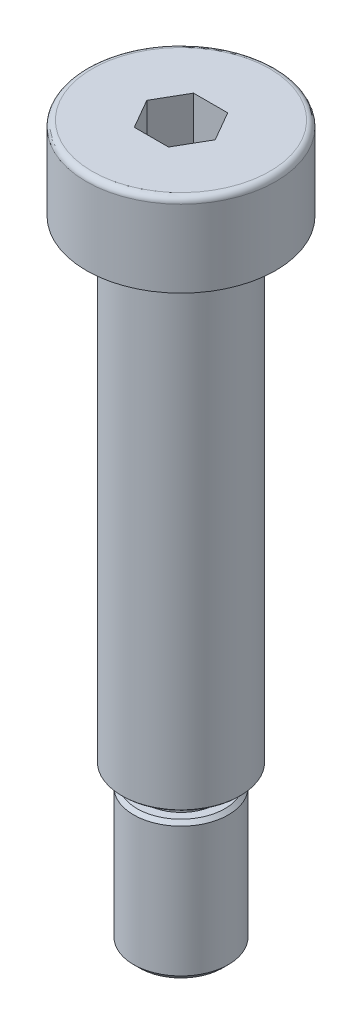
from build123d import *

# Parameters (mm, degrees)
ENL_V_MAT_EXTRU_1_DEPTH = 5
CHANFREIN1_SIZE         = 0.2
CONG_1_R                = 0.1
CHANFREIN2_SIZE         = 0.1
CONG_2_R                = 0.2
CHANFREIN3_SIZE         = 0.5
CHANFREIN4_SIZE         = 0.3


with BuildPart() as part:
    # Esquisse1 → Base-R_volution (revolve)
    with BuildSketch(Plane.XY, mode=Mode.PRIVATE) as base_r_volution_sk:
        with BuildLine():
            Line((0, 60.25), (-7.5, 60.25))
            ThreePointArc((-7.5, 60.25), (-7.853553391, 60.103553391), (-8, 59.75))
            Line((-8, 59.75), (-8, 53.25))
            Line((-8, 53.25), (-4, 53.25))
            Line((-4, 53.25), (-4, 51.75))
            Line((-4, 51.75), (-5, 51.75))
            Line((-5, 51.75), (-5, 13.25))
            Line((-5, 13.25), (-3, 13.25))
            Line((-3, 13.25), (-3, 11.75))
            Line((-3, 11.75), (-4, 11.75))
            Line((-4, 11.75), (-4, 0))
            Line((-4, 0), (0, 0))
            Line((0, 0), (0, 60.25))
        make_face()
    revolve(base_r_volution_sk.sketch.rotate(Axis((0, 50, 0), (0, -1, 0)), 270), axis=Axis((0, 50, 0), (0, -1, 0)))

    # Esquisse2 → Enl_v. mat.-Extru.1 (cut)
    with BuildSketch(Plane(origin=(0, 60.25, 0), x_dir=(-1, 0, 0), z_dir=(0, 1, 0))):
        Polygon((2.886751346, 0), (1.443375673, 2.5), (-1.443375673, 2.5), (-2.886751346, 0), (-1.443375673, -2.5), (1.443375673, -2.5), align=None)
    extrude(amount=-ENL_V_MAT_EXTRU_1_DEPTH, mode=Mode.SUBTRACT)

    # Chanfrein1
    chanfrein1_edges = [part.edges().sort_by_distance(p)[0] for p in [
        (0, 51.75, -5),
    ]]
    chamfer(chanfrein1_edges, length=CHANFREIN1_SIZE)

    # Cong_1
    cong_1_edges = [part.edges().sort_by_distance(p)[0] for p in [
        (0, 53.25, -4),
    ]]
    fillet(cong_1_edges, radius=CONG_1_R)

    # Chanfrein2
    chanfrein2_edges = [part.edges().sort_by_distance(p)[0] for p in [
        (0, 13.25, -5),
    ]]
    chamfer(chanfrein2_edges, length=CHANFREIN2_SIZE)

    # Cong_2
    cong_2_edges = [part.edges().sort_by_distance(p)[0] for p in [
        (0, 13.25, -3),
    ]]
    fillet(cong_2_edges, radius=CONG_2_R)

    # Chanfrein3
    chanfrein3_edges = [part.edges().sort_by_distance(p)[0] for p in [
        (0, 0, -4),
    ]]
    chamfer(chanfrein3_edges, length=CHANFREIN3_SIZE)

    # Chanfrein4
    chanfrein4_edges = [part.edges().sort_by_distance(p)[0] for p in [
        (0, 11.75, -4),
    ]]
    chamfer(chanfrein4_edges, length=CHANFREIN4_SIZE)


solid = part.part
